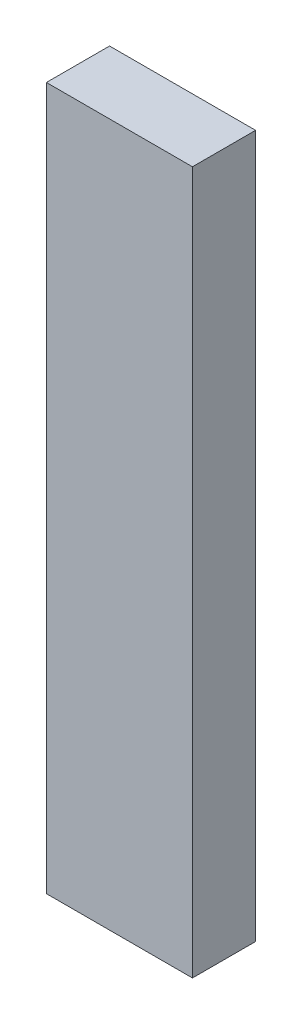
ISO-10303-21;
HEADER;
FILE_DESCRIPTION(('STEP AP214'),'2;1');
FILE_NAME('part.step','',(''),(''),'','','');
FILE_SCHEMA(('AUTOMOTIVE_DESIGN { 1 0 10303 214 1 1 1 1 }'));
ENDSEC;
DATA;
#1=APPLICATION_CONTEXT('core data for automotive mechanical design processes');
#2=APPLICATION_PROTOCOL_DEFINITION('international standard','automotive_design',2000,#1);
#3=PRODUCT_CONTEXT('',#1,'mechanical');
#4=PRODUCT('Part','Part','',(#3));
#5=PRODUCT_RELATED_PRODUCT_CATEGORY('part','',(#4));
#6=PRODUCT_DEFINITION_FORMATION('','',#4);
#7=PRODUCT_DEFINITION_CONTEXT('part definition',#1,'design');
#8=PRODUCT_DEFINITION('design','',#6,#7);
#9=PRODUCT_DEFINITION_SHAPE('','',#8);
#10=(LENGTH_UNIT() NAMED_UNIT(*) SI_UNIT(.MILLI.,.METRE.));
#11=(NAMED_UNIT(*) PLANE_ANGLE_UNIT() SI_UNIT($,.RADIAN.));
#12=(NAMED_UNIT(*) SI_UNIT($,.STERADIAN.) SOLID_ANGLE_UNIT());
#13=UNCERTAINTY_MEASURE_WITH_UNIT(LENGTH_MEASURE(1.E-05),#10,'distance_accuracy_value','');
#14=(GEOMETRIC_REPRESENTATION_CONTEXT(3) GLOBAL_UNCERTAINTY_ASSIGNED_CONTEXT((#13)) GLOBAL_UNIT_ASSIGNED_CONTEXT((#10,
#11,#12)) REPRESENTATION_CONTEXT('',''));
#15=CARTESIAN_POINT('',(0.,0.,0.));
#16=DIRECTION('',(0.,0.,1.));
#17=DIRECTION('',(1.,0.,0.));
#18=AXIS2_PLACEMENT_3D('',#15,#16,#17);
#19=CARTESIAN_POINT('',(0.,0.,8.));
#20=DIRECTION('',(1.,0.,0.));
#21=DIRECTION('',(0.,0.,-1.));
#22=AXIS2_PLACEMENT_3D('',#19,#20,#21);
#23=PLANE('',#22);
#24=DIRECTION('',(0.,-1.,0.));
#25=VECTOR('',#24,1.);
#26=CARTESIAN_POINT('',(0.,0.,0.));
#27=LINE('',#26,#25);
#28=CARTESIAN_POINT('',(0.,89.,0.));
#29=VERTEX_POINT('',#28);
#30=CARTESIAN_POINT('',(0.,0.,0.));
#31=VERTEX_POINT('',#30);
#32=EDGE_CURVE('E94',#29,#31,#27,.T.);
#33=ORIENTED_EDGE('',*,*,#32,.T.);
#34=DIRECTION('',(0.,0.,-1.));
#35=VECTOR('',#34,1.);
#36=CARTESIAN_POINT('',(0.,0.,8.));
#37=LINE('',#36,#35);
#38=CARTESIAN_POINT('',(0.,0.,8.));
#39=VERTEX_POINT('',#38);
#40=EDGE_CURVE('E11',#39,#31,#37,.T.);
#41=ORIENTED_EDGE('',*,*,#40,.F.);
#42=DIRECTION('',(0.,-1.,0.));
#43=VECTOR('',#42,1.);
#44=CARTESIAN_POINT('',(0.,0.,8.));
#45=LINE('',#44,#43);
#46=CARTESIAN_POINT('',(0.,89.,8.));
#47=VERTEX_POINT('',#46);
#48=EDGE_CURVE('E82',#47,#39,#45,.T.);
#49=ORIENTED_EDGE('',*,*,#48,.F.);
#50=DIRECTION('',(0.,0.,-1.));
#51=VECTOR('',#50,1.);
#52=CARTESIAN_POINT('',(0.,89.,8.));
#53=LINE('',#52,#51);
#54=EDGE_CURVE('E90',#47,#29,#53,.T.);
#55=ORIENTED_EDGE('',*,*,#54,.T.);
#56=EDGE_LOOP('',(#33,#41,#49,#55));
#57=FACE_BOUND('',#56,.T.);
#58=ADVANCED_FACE('F31',(#57),#23,.F.);
#59=CARTESIAN_POINT('',(0.,0.,8.));
#60=DIRECTION('',(0.,1.,0.));
#61=DIRECTION('',(0.,0.,1.));
#62=AXIS2_PLACEMENT_3D('',#59,#60,#61);
#63=PLANE('',#62);
#64=DIRECTION('',(1.,0.,0.));
#65=VECTOR('',#64,1.);
#66=CARTESIAN_POINT('',(0.,0.,0.));
#67=LINE('',#66,#65);
#68=CARTESIAN_POINT('',(18.5,0.,0.));
#69=VERTEX_POINT('',#68);
#70=EDGE_CURVE('E86',#31,#69,#67,.T.);
#71=ORIENTED_EDGE('',*,*,#70,.T.);
#72=DIRECTION('',(0.,0.,-1.));
#73=VECTOR('',#72,1.);
#74=CARTESIAN_POINT('',(18.5,0.,8.));
#75=LINE('',#74,#73);
#76=CARTESIAN_POINT('',(18.5,0.,8.));
#77=VERTEX_POINT('',#76);
#78=EDGE_CURVE('E39',#77,#69,#75,.T.);
#79=ORIENTED_EDGE('',*,*,#78,.F.);
#80=DIRECTION('',(1.,0.,0.));
#81=VECTOR('',#80,1.);
#82=CARTESIAN_POINT('',(0.,0.,8.));
#83=LINE('',#82,#81);
#84=EDGE_CURVE('E77',#39,#77,#83,.T.);
#85=ORIENTED_EDGE('',*,*,#84,.F.);
#86=ORIENTED_EDGE('',*,*,#40,.T.);
#87=EDGE_LOOP('',(#71,#79,#85,#86));
#88=FACE_BOUND('',#87,.T.);
#89=ADVANCED_FACE('F85',(#88),#63,.F.);
#90=CARTESIAN_POINT('',(18.5,0.,8.));
#91=DIRECTION('',(-1.,0.,0.));
#92=DIRECTION('',(0.,0.,1.));
#93=AXIS2_PLACEMENT_3D('',#90,#91,#92);
#94=PLANE('',#93);
#95=DIRECTION('',(0.,1.,0.));
#96=VECTOR('',#95,1.);
#97=CARTESIAN_POINT('',(18.5,0.,0.));
#98=LINE('',#97,#96);
#99=CARTESIAN_POINT('',(18.5,89.,0.));
#100=VERTEX_POINT('',#99);
#101=EDGE_CURVE('E64',#69,#100,#98,.T.);
#102=ORIENTED_EDGE('',*,*,#101,.T.);
#103=DIRECTION('',(0.,0.,-1.));
#104=VECTOR('',#103,1.);
#105=CARTESIAN_POINT('',(18.5,89.,8.));
#106=LINE('',#105,#104);
#107=CARTESIAN_POINT('',(18.5,89.,8.));
#108=VERTEX_POINT('',#107);
#109=EDGE_CURVE('E87',#108,#100,#106,.T.);
#110=ORIENTED_EDGE('',*,*,#109,.F.);
#111=DIRECTION('',(0.,1.,0.));
#112=VECTOR('',#111,1.);
#113=CARTESIAN_POINT('',(18.5,0.,8.));
#114=LINE('',#113,#112);
#115=EDGE_CURVE('E80',#77,#108,#114,.T.);
#116=ORIENTED_EDGE('',*,*,#115,.F.);
#117=ORIENTED_EDGE('',*,*,#78,.T.);
#118=EDGE_LOOP('',(#102,#110,#116,#117));
#119=FACE_BOUND('',#118,.T.);
#120=ADVANCED_FACE('F88',(#119),#94,.F.);
#121=CARTESIAN_POINT('',(0.,89.,8.));
#122=DIRECTION('',(0.,-1.,0.));
#123=DIRECTION('',(0.,0.,-1.));
#124=AXIS2_PLACEMENT_3D('',#121,#122,#123);
#125=PLANE('',#124);
#126=DIRECTION('',(-1.,0.,0.));
#127=VECTOR('',#126,1.);
#128=CARTESIAN_POINT('',(0.,89.,0.));
#129=LINE('',#128,#127);
#130=EDGE_CURVE('E70',#100,#29,#129,.T.);
#131=ORIENTED_EDGE('',*,*,#130,.T.);
#132=ORIENTED_EDGE('',*,*,#54,.F.);
#133=DIRECTION('',(-1.,0.,0.));
#134=VECTOR('',#133,1.);
#135=CARTESIAN_POINT('',(0.,89.,8.));
#136=LINE('',#135,#134);
#137=EDGE_CURVE('E47',#108,#47,#136,.T.);
#138=ORIENTED_EDGE('',*,*,#137,.F.);
#139=ORIENTED_EDGE('',*,*,#109,.T.);
#140=EDGE_LOOP('',(#131,#132,#138,#139));
#141=FACE_BOUND('',#140,.T.);
#142=ADVANCED_FACE('F101',(#141),#125,.F.);
#143=CARTESIAN_POINT('',(0.,89.,8.));
#144=DIRECTION('',(0.,0.,-1.));
#145=DIRECTION('',(-1.,0.,0.));
#146=AXIS2_PLACEMENT_3D('',#143,#144,#145);
#147=PLANE('',#146);
#148=ORIENTED_EDGE('',*,*,#48,.T.);
#149=ORIENTED_EDGE('',*,*,#84,.T.);
#150=ORIENTED_EDGE('',*,*,#115,.T.);
#151=ORIENTED_EDGE('',*,*,#137,.T.);
#152=EDGE_LOOP('',(#148,#149,#150,#151));
#153=FACE_BOUND('',#152,.T.);
#154=ADVANCED_FACE('F78',(#153),#147,.F.);
#155=CARTESIAN_POINT('',(0.,89.,0.));
#156=DIRECTION('',(0.,0.,-1.));
#157=DIRECTION('',(-1.,0.,0.));
#158=AXIS2_PLACEMENT_3D('',#155,#156,#157);
#159=PLANE('',#158);
#160=ORIENTED_EDGE('',*,*,#32,.F.);
#161=ORIENTED_EDGE('',*,*,#130,.F.);
#162=ORIENTED_EDGE('',*,*,#101,.F.);
#163=ORIENTED_EDGE('',*,*,#70,.F.);
#164=EDGE_LOOP('',(#160,#161,#162,#163));
#165=FACE_BOUND('',#164,.T.);
#166=ADVANCED_FACE('F104',(#165),#159,.T.);
#167=CLOSED_SHELL('',(#58,#89,#120,#142,#154,#166));
#168=MANIFOLD_SOLID_BREP('B2',#167);
#169=ADVANCED_BREP_SHAPE_REPRESENTATION('',(#18,#168),#14);
#170=SHAPE_DEFINITION_REPRESENTATION(#9,#169);
ENDSEC;
END-ISO-10303-21;
